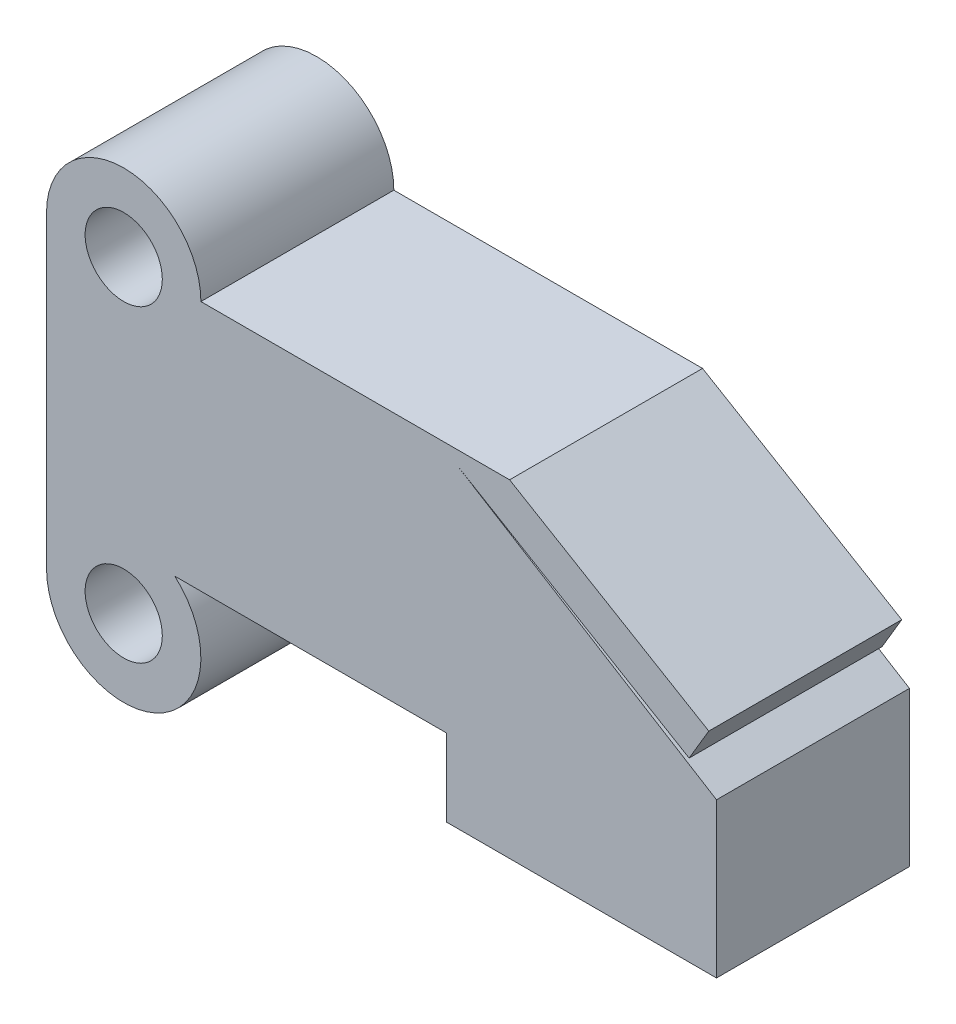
from build123d import *

# Parameters (mm, degrees)
ESQUISSE1_R          = 1
BASE_EXTRUSION_DEPTH = 5


with BuildPart() as part:
    # Esquisse1 → Base-Extrusion (new body)
    with BuildSketch(Plane.XY):
        with BuildLine():
            Line((2, 0), (10, 0))
            Line((10, 0), (15.161843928, -3.058654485))
            Line((15.161843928, -3.058654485), (14.652068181, -3.918961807))
            Line((14.652068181, -3.918961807), (8.629916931, -0.350531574))
            Line((8.629916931, -0.350531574), (15.361902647, -4.5))
            Line((15.361902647, -4.5), (15.361902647, -8.5))
            Line((15.361902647, -8.5), (8.361902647, -8.5))
            Line((8.361902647, -8.5), (8.361902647, -6.5))
            Line((8.361902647, -6.5), (1.322875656, -6.5))
            ThreePointArc((1.322875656, -6.5), (0.822875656, -9.822875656), (-2, -8))
            Line((-2, -8), (-2, 0))
            ThreePointArc((-2, 0), (0, 2), (2, 0))
        make_face()
        Circle(ESQUISSE1_R, mode=Mode.SUBTRACT)
        with Locations((0, -8)):
            Circle(ESQUISSE1_R, mode=Mode.SUBTRACT)
    extrude(amount=BASE_EXTRUSION_DEPTH)


solid = part.part
